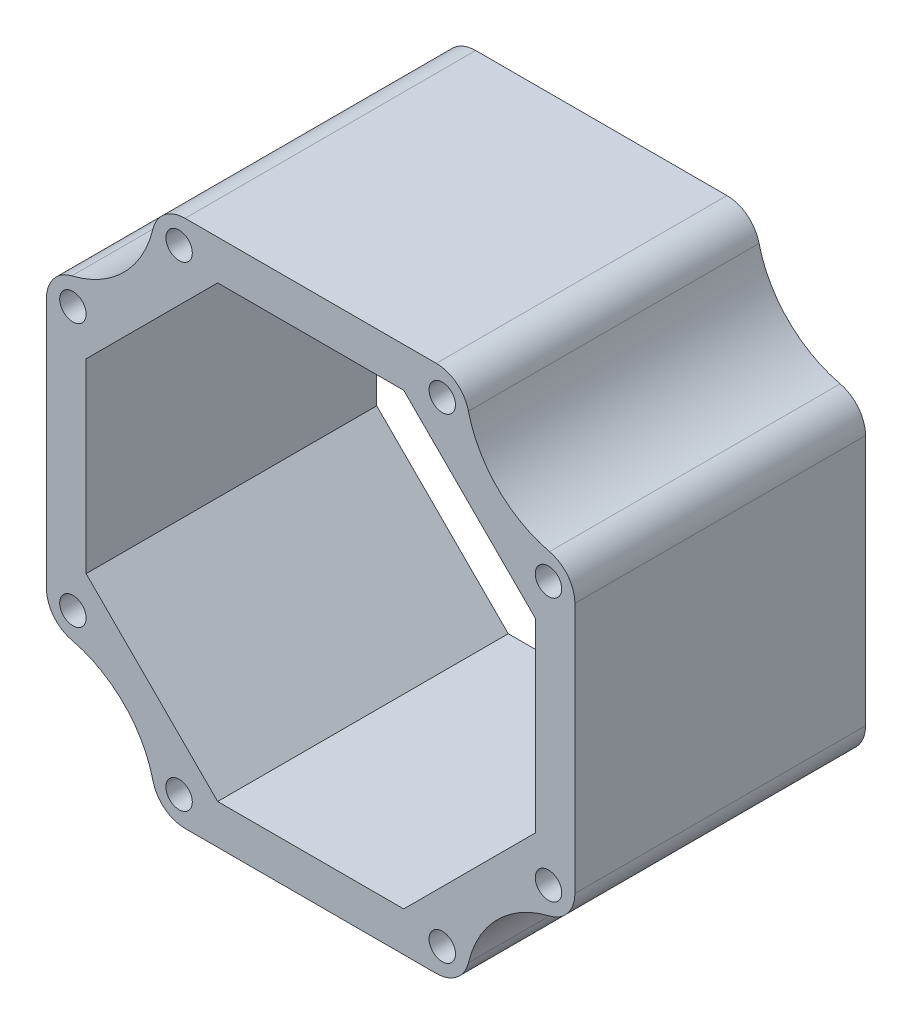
from build123d import *

# Parameters (mm, degrees)
BOSS_EXTRUDE1_DEPTH      = 11
BOSS_EXTRUDE1_DEPTH_BACK = 11
FILLET1_R                = 2.5
CUT_EXTRUDE1_DEPTH       = 22


with BuildPart() as part:
    # Sketch1 → Boss-Extrude1 (new, two sides: drawn at the far end of the back side and taken through both)
    with BuildSketch(Plane.XY.offset(-BOSS_EXTRUDE1_DEPTH_BACK)):
        with BuildLine():
            Line((-11.715728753, 20), (11.715728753, 20))
            ThreePointArc((11.715728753, 20), (14.142135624, 14.142135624), (20, 11.715728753))
            Line((20, 11.715728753), (20, -11.715728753))
            ThreePointArc((20, -11.715728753), (14.142135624, -14.142135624), (11.715728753, -20))
            Line((11.715728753, -20), (-11.715728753, -20))
            ThreePointArc((-11.715728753, -20), (-14.142135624, -14.142135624), (-20, -11.715728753))
            Line((-20, -11.715728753), (-20, 11.715728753))
            ThreePointArc((-20, 11.715728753), (-14.142135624, 14.142135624), (-11.715728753, 20))
        make_face()
        Polygon((-7.04163056, 17), (7.04163056, 17), (17, 7.04163056), (17, -7.04163056), (7.04163056, -17), (-7.04163056, -17), (-17, -7.04163056), (-17, 7.04163056), align=None, mode=Mode.SUBTRACT)
    extrude(amount=BOSS_EXTRUDE1_DEPTH + BOSS_EXTRUDE1_DEPTH_BACK)

    # Fillet1
    fillet1_edges = [part.edges().sort_by_distance(p)[0] for p in [
        (20, 11.715728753, 0),
        (20, -11.715728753, 0),
        (11.715728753, -20, 0),
        (-11.715728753, -20, 0),
        (-20, -11.715728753, 0),
        (-20, 11.715728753, 0),
        (-11.715728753, 20, 0),
        (11.715728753, 20, 0),
    ]]
    fillet(fillet1_edges, radius=FILLET1_R)

    # Sketch3 → Cut-Extrude1 (cut)
    with BuildSketch(Plane.XY.offset(11)):
        with BuildLine():
            ThreePointArc((-18, 10.960774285), (-19, 9.960774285), (-18, 8.960774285))
            Line((-18, 8.960774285), (-18, 10.960774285))
        make_face()
        with BuildLine():
            Line((-18, 10.960774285), (-18, 8.960774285))
            ThreePointArc((-18, 8.960774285), (-17.292893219, 9.253667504), (-17, 9.960774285))
            ThreePointArc((-17, 9.960774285), (-17.292893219, 10.667881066), (-18, 10.960774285))
        make_face()
        with BuildLine():
            ThreePointArc((-18, 10.960774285), (-19, 9.960774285), (-18, 8.960774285))
            Line((-18, 8.960774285), (-18, 10.960774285))
        make_face()
        with BuildLine():
            Line((-18, 10.960774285), (-18, 8.960774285))
            ThreePointArc((-18, 8.960774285), (-17.292893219, 9.253667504), (-17, 9.960774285))
            ThreePointArc((-17, 9.960774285), (-17.292893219, 10.667881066), (-18, 10.960774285))
        make_face()
        with BuildLine():
            ThreePointArc((-8.960774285, 18), (-9.960774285, 19), (-10.960774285, 18))
            Line((-10.960774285, 18), (-8.960774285, 18))
        make_face()
        with BuildLine():
            Line((-8.960774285, 18), (-10.960774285, 18))
            ThreePointArc((-10.960774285, 18), (-9.960774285, 17), (-8.960774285, 18))
        make_face()
        with BuildLine():
            ThreePointArc((-8.960774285, 18), (-9.960774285, 19), (-10.960774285, 18))
            Line((-10.960774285, 18), (-8.960774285, 18))
        make_face()
        with BuildLine():
            Line((-8.960774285, 18), (-10.960774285, 18))
            ThreePointArc((-10.960774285, 18), (-9.960774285, 17), (-8.960774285, 18))
        make_face()
        with BuildLine():
            ThreePointArc((10.960774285, 18), (9.960774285, 19), (8.960774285, 18))
            Line((8.960774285, 18), (10.960774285, 18))
        make_face()
        with BuildLine():
            Line((10.960774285, 18), (8.960774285, 18))
            ThreePointArc((8.960774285, 18), (9.960774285, 17), (10.960774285, 18))
        make_face()
        with BuildLine():
            ThreePointArc((10.960774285, 18), (9.960774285, 19), (8.960774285, 18))
            Line((8.960774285, 18), (10.960774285, 18))
        make_face()
        with BuildLine():
            Line((10.960774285, 18), (8.960774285, 18))
            ThreePointArc((8.960774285, 18), (9.960774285, 17), (10.960774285, 18))
        make_face()
        with BuildLine():
            ThreePointArc((19, 9.960774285), (18.707106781, 10.667881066), (18, 10.960774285))
            Line((18, 10.960774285), (18, 8.960774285))
            ThreePointArc((18, 8.960774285), (18.707106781, 9.253667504), (19, 9.960774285))
        make_face()
        with BuildLine():
            Line((18, 8.960774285), (18, 10.960774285))
            ThreePointArc((18, 10.960774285), (17, 9.960774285), (18, 8.960774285))
        make_face()
        with BuildLine():
            ThreePointArc((19, 9.960774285), (18.707106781, 10.667881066), (18, 10.960774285))
            Line((18, 10.960774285), (18, 8.960774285))
            ThreePointArc((18, 8.960774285), (18.707106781, 9.253667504), (19, 9.960774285))
        make_face()
        with BuildLine():
            Line((18, 8.960774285), (18, 10.960774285))
            ThreePointArc((18, 10.960774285), (17, 9.960774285), (18, 8.960774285))
        make_face()
        with BuildLine():
            ThreePointArc((19, -9.960774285), (18.707106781, -9.253667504), (18, -8.960774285))
            Line((18, -8.960774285), (18, -10.960774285))
            ThreePointArc((18, -10.960774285), (18.707106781, -10.667881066), (19, -9.960774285))
        make_face()
        with BuildLine():
            Line((18, -10.960774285), (18, -8.960774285))
            ThreePointArc((18, -8.960774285), (17, -9.960774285), (18, -10.960774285))
        make_face()
        with BuildLine():
            ThreePointArc((19, -9.960774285), (18.707106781, -9.253667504), (18, -8.960774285))
            Line((18, -8.960774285), (18, -10.960774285))
            ThreePointArc((18, -10.960774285), (18.707106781, -10.667881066), (19, -9.960774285))
        make_face()
        with BuildLine():
            Line((18, -10.960774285), (18, -8.960774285))
            ThreePointArc((18, -8.960774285), (17, -9.960774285), (18, -10.960774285))
        make_face()
        with BuildLine():
            ThreePointArc((8.960774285, -18), (9.960774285, -19), (10.960774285, -18))
            Line((10.960774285, -18), (8.960774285, -18))
        make_face()
        with BuildLine():
            Line((8.960774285, -18), (10.960774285, -18))
            ThreePointArc((10.960774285, -18), (9.960774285, -17), (8.960774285, -18))
        make_face()
        with BuildLine():
            ThreePointArc((8.960774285, -18), (9.960774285, -19), (10.960774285, -18))
            Line((10.960774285, -18), (8.960774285, -18))
        make_face()
        with BuildLine():
            Line((8.960774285, -18), (10.960774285, -18))
            ThreePointArc((10.960774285, -18), (9.960774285, -17), (8.960774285, -18))
        make_face()
        with BuildLine():
            ThreePointArc((-10.960774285, -18), (-9.960774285, -19), (-8.960774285, -18))
            Line((-8.960774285, -18), (-10.960774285, -18))
        make_face()
        with BuildLine():
            Line((-10.960774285, -18), (-8.960774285, -18))
            ThreePointArc((-8.960774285, -18), (-9.960774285, -17), (-10.960774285, -18))
        make_face()
        with BuildLine():
            ThreePointArc((-10.960774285, -18), (-9.960774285, -19), (-8.960774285, -18))
            Line((-8.960774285, -18), (-10.960774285, -18))
        make_face()
        with BuildLine():
            Line((-10.960774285, -18), (-8.960774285, -18))
            ThreePointArc((-8.960774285, -18), (-9.960774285, -17), (-10.960774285, -18))
        make_face()
        with BuildLine():
            ThreePointArc((-18, -8.960774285), (-19, -9.960774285), (-18, -10.960774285))
            Line((-18, -10.960774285), (-18, -8.960774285))
        make_face()
        with BuildLine():
            Line((-18, -8.960774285), (-18, -10.960774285))
            ThreePointArc((-18, -10.960774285), (-17.292893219, -10.667881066), (-17, -9.960774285))
            ThreePointArc((-17, -9.960774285), (-17.292893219, -9.253667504), (-18, -8.960774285))
        make_face()
        with BuildLine():
            ThreePointArc((-18, -8.960774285), (-19, -9.960774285), (-18, -10.960774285))
            Line((-18, -10.960774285), (-18, -8.960774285))
        make_face()
        with BuildLine():
            Line((-18, -8.960774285), (-18, -10.960774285))
            ThreePointArc((-18, -10.960774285), (-17.292893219, -10.667881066), (-17, -9.960774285))
            ThreePointArc((-17, -9.960774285), (-17.292893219, -9.253667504), (-18, -8.960774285))
        make_face()
    extrude(amount=-CUT_EXTRUDE1_DEPTH, mode=Mode.SUBTRACT)


solid = part.part
